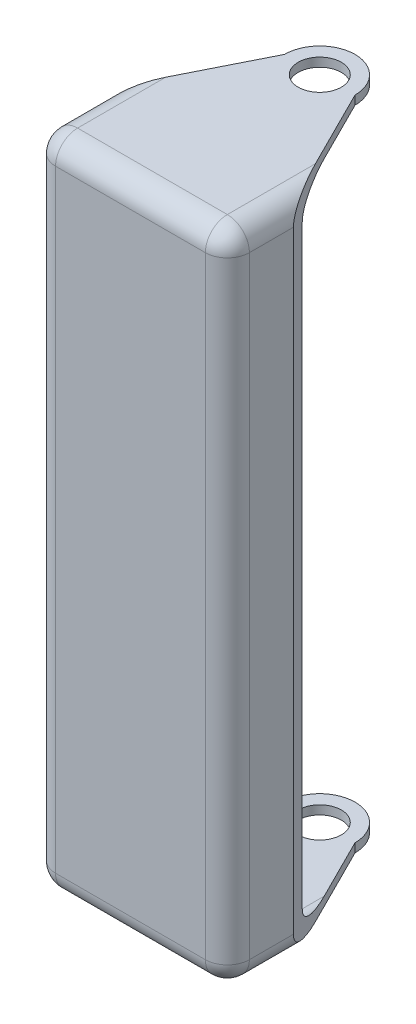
from build123d import *

# Parameters (mm, degrees)
BOSS_EXTRUDE4_DEPTH = 184.15
SHELL2_T            = 2.54
SKETCH12_R          = 6.226460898
CUT_EXTRUDE1_DEPTH  = 190.5
FILLET4_R           = 6.35


with BuildPart() as part:
    # Sketch1 → Boss-Extrude4 (new body)
    with BuildSketch(Plane(origin=(0, 0, 0), x_dir=(1, 0, 0), z_dir=(0, 1, 0))):
        with BuildLine():
            Line((-30.477371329, -27.472144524), (20.322628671, -27.472144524))
            Line((20.322628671, -27.472144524), (20.322628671, -5.882144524))
            Line((20.322628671, -5.882144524), (5.082628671, 24.566402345))
            ThreePointArc((5.082628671, 24.566402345), (-5.077371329, 34.726402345), (-15.237371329, 24.566402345))
            Line((-15.237371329, 24.566402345), (-30.477371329, -5.882144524))
            Line((-30.477371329, -5.882144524), (-30.477371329, -27.472144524))
        make_face()
    extrude(amount=BOSS_EXTRUDE4_DEPTH)

    # Shell2
    shell2_openings = [part.faces().sort_by_distance(p)[0] for p in [
        (12.702628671, 92.075, -9.342128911),
        (-5.077371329, 92.075, -34.726402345),
        (-22.857371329, 92.075, -9.342128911),
    ]]
    offset(amount=SHELL2_T, openings=shell2_openings, kind=Kind.INTERSECTION)

    # Sketch12 → Cut-Extrude1 (cut)
    with BuildSketch(Plane(origin=(0, 186.69, 0), x_dir=(1, 0, 0), z_dir=(0, 1, 0))):
        with Locations(Location((-5.077371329, 24.566402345, 0), (0, 0, 270))):
            Circle(SKETCH12_R)
    extrude(amount=-CUT_EXTRUDE1_DEPTH, mode=Mode.SUBTRACT)

    # Fillet4
    fillet4_edges = [part.edges().sort_by_distance(p)[0] for p in [
        (22.862628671, 92.075, 30.012144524),
        (-33.017371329, 92.075, 30.012144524),
        (-33.017371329, 186.69, 20.48452343),
        (-5.077371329, 186.69, 30.012144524),
        (20.322628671, 0, 16.677144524),
        (20.322628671, 92.075, 27.472144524),
        (-30.477371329, 0, 16.677144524),
        (-5.077371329, 0, 27.472144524),
        (-30.477371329, 92.075, 27.472144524),
        (20.322628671, 184.15, 16.677144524),
        (-30.477371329, 184.15, 16.677144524),
        (-5.077371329, 184.15, 27.472144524),
        (22.862628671, 186.69, 20.48452343),
        (-5.077371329, -2.54, 30.012144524),
        (-33.017371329, -2.54, 20.48452343),
        (22.862628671, -2.54, 20.48452343),
    ]]
    fillet(fillet4_edges, radius=FILLET4_R)


solid = part.part
